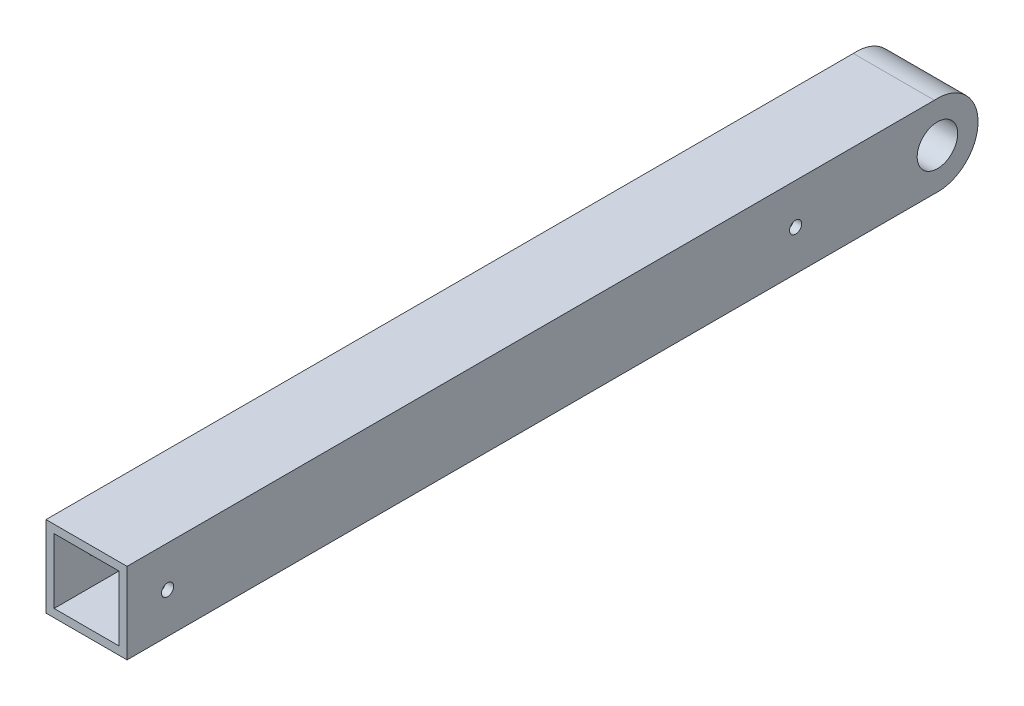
ISO-10303-21;
HEADER;
FILE_DESCRIPTION(('STEP AP214'),'2;1');
FILE_NAME('part.step','',(''),(''),'','','');
FILE_SCHEMA(('AUTOMOTIVE_DESIGN { 1 0 10303 214 1 1 1 1 }'));
ENDSEC;
DATA;
#1=APPLICATION_CONTEXT('core data for automotive mechanical design processes');
#2=APPLICATION_PROTOCOL_DEFINITION('international standard','automotive_design',2000,#1);
#3=PRODUCT_CONTEXT('',#1,'mechanical');
#4=PRODUCT('Part','Part','',(#3));
#5=PRODUCT_RELATED_PRODUCT_CATEGORY('part','',(#4));
#6=PRODUCT_DEFINITION_FORMATION('','',#4);
#7=PRODUCT_DEFINITION_CONTEXT('part definition',#1,'design');
#8=PRODUCT_DEFINITION('design','',#6,#7);
#9=PRODUCT_DEFINITION_SHAPE('','',#8);
#10=(LENGTH_UNIT() NAMED_UNIT(*) SI_UNIT(.MILLI.,.METRE.));
#11=(NAMED_UNIT(*) PLANE_ANGLE_UNIT() SI_UNIT($,.RADIAN.));
#12=(NAMED_UNIT(*) SI_UNIT($,.STERADIAN.) SOLID_ANGLE_UNIT());
#13=UNCERTAINTY_MEASURE_WITH_UNIT(LENGTH_MEASURE(1.E-05),#10,'distance_accuracy_value','');
#14=(GEOMETRIC_REPRESENTATION_CONTEXT(3) GLOBAL_UNCERTAINTY_ASSIGNED_CONTEXT((#13)) GLOBAL_UNIT_ASSIGNED_CONTEXT((#10,
#11,#12)) REPRESENTATION_CONTEXT('',''));
#15=CARTESIAN_POINT('',(0.,0.,0.));
#16=DIRECTION('',(0.,0.,1.));
#17=DIRECTION('',(1.,0.,0.));
#18=AXIS2_PLACEMENT_3D('',#15,#16,#17);
#19=CARTESIAN_POINT('',(0.,0.,200.));
#20=DIRECTION('',(0.,0.,1.));
#21=DIRECTION('',(1.,0.,0.));
#22=AXIS2_PLACEMENT_3D('',#19,#20,#21);
#23=PLANE('',#22);
#24=DIRECTION('',(0.,1.,0.));
#25=VECTOR('',#24,1.);
#26=CARTESIAN_POINT('',(0.,0.,200.));
#27=LINE('',#26,#25);
#28=CARTESIAN_POINT('',(0.,0.,200.));
#29=VERTEX_POINT('',#28);
#30=CARTESIAN_POINT('',(0.,20.,200.));
#31=VERTEX_POINT('',#30);
#32=EDGE_CURVE('E142',#29,#31,#27,.T.);
#33=ORIENTED_EDGE('',*,*,#32,.T.);
#34=DIRECTION('',(-1.,0.,0.));
#35=VECTOR('',#34,1.);
#36=CARTESIAN_POINT('',(0.,20.,200.));
#37=LINE('',#36,#35);
#38=CARTESIAN_POINT('',(-20.,20.,200.));
#39=VERTEX_POINT('',#38);
#40=EDGE_CURVE('E145',#31,#39,#37,.T.);
#41=ORIENTED_EDGE('',*,*,#40,.T.);
#42=DIRECTION('',(0.,1.,0.));
#43=VECTOR('',#42,1.);
#44=CARTESIAN_POINT('',(-20.,0.,200.));
#45=LINE('',#44,#43);
#46=CARTESIAN_POINT('',(-20.,0.,200.));
#47=VERTEX_POINT('',#46);
#48=EDGE_CURVE('E147',#47,#39,#45,.T.);
#49=ORIENTED_EDGE('',*,*,#48,.F.);
#50=DIRECTION('',(-1.,0.,0.));
#51=VECTOR('',#50,1.);
#52=CARTESIAN_POINT('',(0.,0.,200.));
#53=LINE('',#52,#51);
#54=EDGE_CURVE('E150',#29,#47,#53,.T.);
#55=ORIENTED_EDGE('',*,*,#54,.F.);
#56=EDGE_LOOP('',(#33,#41,#49,#55));
#57=FACE_BOUND('',#56,.T.);
#58=DIRECTION('',(-1.,0.,0.));
#59=VECTOR('',#58,1.);
#60=CARTESIAN_POINT('',(-2.,18.,200.));
#61=LINE('',#60,#59);
#62=CARTESIAN_POINT('',(-2.,18.,200.));
#63=VERTEX_POINT('',#62);
#64=CARTESIAN_POINT('',(-18.,18.,200.));
#65=VERTEX_POINT('',#64);
#66=EDGE_CURVE('E117',#63,#65,#61,.T.);
#67=ORIENTED_EDGE('',*,*,#66,.F.);
#68=DIRECTION('',(0.,-1.,0.));
#69=VECTOR('',#68,1.);
#70=CARTESIAN_POINT('',(-2.,18.,200.));
#71=LINE('',#70,#69);
#72=CARTESIAN_POINT('',(-2.,2.00000000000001,200.));
#73=VERTEX_POINT('',#72);
#74=EDGE_CURVE('E50',#63,#73,#71,.T.);
#75=ORIENTED_EDGE('',*,*,#74,.T.);
#76=DIRECTION('',(-1.,0.,0.));
#77=VECTOR('',#76,1.);
#78=CARTESIAN_POINT('',(-2.,2.00000000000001,200.));
#79=LINE('',#78,#77);
#80=CARTESIAN_POINT('',(-18.,2.00000000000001,200.));
#81=VERTEX_POINT('',#80);
#82=EDGE_CURVE('E121',#73,#81,#79,.T.);
#83=ORIENTED_EDGE('',*,*,#82,.T.);
#84=DIRECTION('',(0.,-1.,0.));
#85=VECTOR('',#84,1.);
#86=CARTESIAN_POINT('',(-18.,18.,200.));
#87=LINE('',#86,#85);
#88=EDGE_CURVE('E184',#65,#81,#87,.T.);
#89=ORIENTED_EDGE('',*,*,#88,.F.);
#90=EDGE_LOOP('',(#67,#75,#83,#89));
#91=FACE_BOUND('',#90,.T.);
#92=ADVANCED_FACE('F33',(#57,#91),#23,.T.);
#93=CARTESIAN_POINT('',(0.,0.,200.));
#94=DIRECTION('',(-1.,0.,0.));
#95=DIRECTION('',(0.,-1.,0.));
#96=AXIS2_PLACEMENT_3D('',#93,#94,#95);
#97=PLANE('',#96);
#98=CARTESIAN_POINT('',(0.,10.,190.));
#99=DIRECTION('',(1.,0.,0.));
#100=DIRECTION('',(0.,1.,0.));
#101=AXIS2_PLACEMENT_3D('',#98,#99,#100);
#102=CIRCLE('',#101,1.5);
#103=CARTESIAN_POINT('',(0.,11.5,190.));
#104=VERTEX_POINT('',#103);
#105=EDGE_CURVE('E267',#104,#104,#102,.T.);
#106=ORIENTED_EDGE('',*,*,#105,.F.);
#107=EDGE_LOOP('',(#106));
#108=FACE_BOUND('',#107,.T.);
#109=CARTESIAN_POINT('',(0.,10.,35.));
#110=DIRECTION('',(1.,0.,0.));
#111=DIRECTION('',(0.,1.,0.));
#112=AXIS2_PLACEMENT_3D('',#109,#110,#111);
#113=CIRCLE('',#112,1.5);
#114=CARTESIAN_POINT('',(0.,11.5,35.));
#115=VERTEX_POINT('',#114);
#116=EDGE_CURVE('E169',#115,#115,#113,.T.);
#117=ORIENTED_EDGE('',*,*,#116,.F.);
#118=EDGE_LOOP('',(#117));
#119=FACE_BOUND('',#118,.T.);
#120=CARTESIAN_POINT('',(0.,10.,0.));
#121=DIRECTION('',(1.,0.,0.));
#122=DIRECTION('',(0.,1.,0.));
#123=AXIS2_PLACEMENT_3D('',#120,#121,#122);
#124=CIRCLE('',#123,5.);
#125=CARTESIAN_POINT('',(0.,15.,0.));
#126=VERTEX_POINT('',#125);
#127=EDGE_CURVE('E122',#126,#126,#124,.T.);
#128=ORIENTED_EDGE('',*,*,#127,.F.);
#129=EDGE_LOOP('',(#128));
#130=FACE_BOUND('',#129,.T.);
#131=DIRECTION('',(0.,0.,-1.));
#132=VECTOR('',#131,1.);
#133=CARTESIAN_POINT('',(0.,0.,200.));
#134=LINE('',#133,#132);
#135=CARTESIAN_POINT('',(0.,0.,0.757787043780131));
#136=VERTEX_POINT('',#135);
#137=EDGE_CURVE('E58',#29,#136,#134,.T.);
#138=ORIENTED_EDGE('',*,*,#137,.T.);
#139=CARTESIAN_POINT('',(0.,10.,0.));
#140=DIRECTION('',(1.,0.,0.));
#141=DIRECTION('',(0.,1.,0.));
#142=AXIS2_PLACEMENT_3D('',#139,#140,#141);
#143=CIRCLE('',#142,10.0286709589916);
#144=CARTESIAN_POINT('',(0.,20.,0.757787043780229));
#145=VERTEX_POINT('',#144);
#146=EDGE_CURVE('E133',#136,#145,#143,.T.);
#147=ORIENTED_EDGE('',*,*,#146,.T.);
#148=DIRECTION('',(0.,0.,-1.));
#149=VECTOR('',#148,1.);
#150=CARTESIAN_POINT('',(0.,20.,200.));
#151=LINE('',#150,#149);
#152=EDGE_CURVE('E42',#31,#145,#151,.T.);
#153=ORIENTED_EDGE('',*,*,#152,.F.);
#154=ORIENTED_EDGE('',*,*,#32,.F.);
#155=EDGE_LOOP('',(#138,#147,#153,#154));
#156=FACE_BOUND('',#155,.T.);
#157=ADVANCED_FACE('F35',(#108,#119,#130,#156),#97,.F.);
#158=CARTESIAN_POINT('',(0.,20.,200.));
#159=DIRECTION('',(0.,-1.,0.));
#160=DIRECTION('',(1.,0.,0.));
#161=AXIS2_PLACEMENT_3D('',#158,#159,#160);
#162=PLANE('',#161);
#163=ORIENTED_EDGE('',*,*,#152,.T.);
#164=DIRECTION('',(1.,0.,0.));
#165=VECTOR('',#164,1.);
#166=CARTESIAN_POINT('',(-48.3653649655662,20.,0.757787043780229));
#167=LINE('',#166,#165);
#168=CARTESIAN_POINT('',(-20.,20.,0.757787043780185));
#169=VERTEX_POINT('',#168);
#170=EDGE_CURVE('E139',#145,#169,#167,.F.);
#171=ORIENTED_EDGE('',*,*,#170,.T.);
#172=DIRECTION('',(0.,0.,-1.));
#173=VECTOR('',#172,1.);
#174=CARTESIAN_POINT('',(-20.,20.,200.));
#175=LINE('',#174,#173);
#176=EDGE_CURVE('E156',#39,#169,#175,.T.);
#177=ORIENTED_EDGE('',*,*,#176,.F.);
#178=ORIENTED_EDGE('',*,*,#40,.F.);
#179=EDGE_LOOP('',(#163,#171,#177,#178));
#180=FACE_BOUND('',#179,.T.);
#181=ADVANCED_FACE('F202',(#180),#162,.F.);
#182=CARTESIAN_POINT('',(-20.,0.,200.));
#183=DIRECTION('',(-1.,0.,0.));
#184=DIRECTION('',(0.,0.,1.));
#185=AXIS2_PLACEMENT_3D('',#182,#183,#184);
#186=PLANE('',#185);
#187=CARTESIAN_POINT('',(-20.,10.,190.));
#188=DIRECTION('',(1.,0.,0.));
#189=DIRECTION('',(0.,1.,0.));
#190=AXIS2_PLACEMENT_3D('',#187,#188,#189);
#191=CIRCLE('',#190,1.5);
#192=CARTESIAN_POINT('',(-20.,11.5,190.));
#193=VERTEX_POINT('',#192);
#194=EDGE_CURVE('E268',#193,#193,#191,.T.);
#195=ORIENTED_EDGE('',*,*,#194,.T.);
#196=EDGE_LOOP('',(#195));
#197=FACE_BOUND('',#196,.T.);
#198=CARTESIAN_POINT('',(-20.,10.,35.));
#199=DIRECTION('',(1.,0.,0.));
#200=DIRECTION('',(0.,1.,0.));
#201=AXIS2_PLACEMENT_3D('',#198,#199,#200);
#202=CIRCLE('',#201,1.5);
#203=CARTESIAN_POINT('',(-20.,11.5,35.));
#204=VERTEX_POINT('',#203);
#205=EDGE_CURVE('E163',#204,#204,#202,.T.);
#206=ORIENTED_EDGE('',*,*,#205,.T.);
#207=EDGE_LOOP('',(#206));
#208=FACE_BOUND('',#207,.T.);
#209=CARTESIAN_POINT('',(-20.,10.,0.));
#210=DIRECTION('',(1.,0.,0.));
#211=DIRECTION('',(0.,1.,0.));
#212=AXIS2_PLACEMENT_3D('',#209,#210,#211);
#213=CIRCLE('',#212,5.);
#214=CARTESIAN_POINT('',(-20.,15.,0.));
#215=VERTEX_POINT('',#214);
#216=EDGE_CURVE('E126',#215,#215,#213,.T.);
#217=ORIENTED_EDGE('',*,*,#216,.T.);
#218=EDGE_LOOP('',(#217));
#219=FACE_BOUND('',#218,.T.);
#220=ORIENTED_EDGE('',*,*,#176,.T.);
#221=CARTESIAN_POINT('',(-20.,10.,0.));
#222=DIRECTION('',(-1.,0.,0.));
#223=DIRECTION('',(0.,0.,1.));
#224=AXIS2_PLACEMENT_3D('',#221,#222,#223);
#225=CIRCLE('',#224,10.0286709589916);
#226=CARTESIAN_POINT('',(-20.,0.,0.757787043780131));
#227=VERTEX_POINT('',#226);
#228=EDGE_CURVE('E137',#227,#169,#225,.F.);
#229=ORIENTED_EDGE('',*,*,#228,.F.);
#230=DIRECTION('',(0.,0.,-1.));
#231=VECTOR('',#230,1.);
#232=CARTESIAN_POINT('',(-20.,0.,200.));
#233=LINE('',#232,#231);
#234=EDGE_CURVE('E153',#47,#227,#233,.T.);
#235=ORIENTED_EDGE('',*,*,#234,.F.);
#236=ORIENTED_EDGE('',*,*,#48,.T.);
#237=EDGE_LOOP('',(#220,#229,#235,#236));
#238=FACE_BOUND('',#237,.T.);
#239=ADVANCED_FACE('F211',(#197,#208,#219,#238),#186,.T.);
#240=CARTESIAN_POINT('',(0.,0.,200.));
#241=DIRECTION('',(0.,-1.,0.));
#242=DIRECTION('',(0.,0.,-1.));
#243=AXIS2_PLACEMENT_3D('',#240,#241,#242);
#244=PLANE('',#243);
#245=DIRECTION('',(1.,0.,0.));
#246=VECTOR('',#245,1.);
#247=CARTESIAN_POINT('',(-48.3653649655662,0.,0.757787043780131));
#248=LINE('',#247,#246);
#249=EDGE_CURVE('E11',#136,#227,#248,.F.);
#250=ORIENTED_EDGE('',*,*,#249,.F.);
#251=ORIENTED_EDGE('',*,*,#137,.F.);
#252=ORIENTED_EDGE('',*,*,#54,.T.);
#253=ORIENTED_EDGE('',*,*,#234,.T.);
#254=EDGE_LOOP('',(#250,#251,#252,#253));
#255=FACE_BOUND('',#254,.T.);
#256=ADVANCED_FACE('F208',(#255),#244,.T.);
#257=CARTESIAN_POINT('',(-48.3653649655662,10.,0.));
#258=DIRECTION('',(1.,0.,0.));
#259=DIRECTION('',(0.,1.,0.));
#260=AXIS2_PLACEMENT_3D('',#257,#258,#259);
#261=CYLINDRICAL_SURFACE('',#260,10.0286709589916);
#262=ORIENTED_EDGE('',*,*,#170,.F.);
#263=ORIENTED_EDGE('',*,*,#146,.F.);
#264=ORIENTED_EDGE('',*,*,#249,.T.);
#265=ORIENTED_EDGE('',*,*,#228,.T.);
#266=EDGE_LOOP('',(#262,#263,#264,#265));
#267=FACE_BOUND('',#266,.T.);
#268=ADVANCED_FACE('F206',(#267),#261,.T.);
#269=CARTESIAN_POINT('',(-20.,10.,0.));
#270=DIRECTION('',(1.,0.,0.));
#271=DIRECTION('',(0.,1.,0.));
#272=AXIS2_PLACEMENT_3D('',#269,#270,#271);
#273=CYLINDRICAL_SURFACE('',#272,5.);
#274=ORIENTED_EDGE('',*,*,#216,.F.);
#275=EDGE_LOOP('',(#274));
#276=FACE_BOUND('',#275,.T.);
#277=ORIENTED_EDGE('',*,*,#127,.T.);
#278=EDGE_LOOP('',(#277));
#279=FACE_BOUND('',#278,.T.);
#280=ADVANCED_FACE('F227',(#276,#279),#273,.F.);
#281=CARTESIAN_POINT('',(-2.,18.,30.));
#282=DIRECTION('',(-1.,0.,0.));
#283=DIRECTION('',(0.,-1.,0.));
#284=AXIS2_PLACEMENT_3D('',#281,#282,#283);
#285=PLANE('',#284);
#286=CARTESIAN_POINT('',(-2.,10.,190.));
#287=DIRECTION('',(-1.,0.,0.));
#288=DIRECTION('',(0.,-1.,0.));
#289=AXIS2_PLACEMENT_3D('',#286,#287,#288);
#290=CIRCLE('',#289,1.5);
#291=CARTESIAN_POINT('',(-2.,8.50000000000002,190.));
#292=VERTEX_POINT('',#291);
#293=EDGE_CURVE('E174',#292,#292,#290,.T.);
#294=ORIENTED_EDGE('',*,*,#293,.F.);
#295=EDGE_LOOP('',(#294));
#296=FACE_BOUND('',#295,.T.);
#297=CARTESIAN_POINT('',(-2.,10.,35.));
#298=DIRECTION('',(-1.,0.,0.));
#299=DIRECTION('',(0.,-1.,0.));
#300=AXIS2_PLACEMENT_3D('',#297,#298,#299);
#301=CIRCLE('',#300,1.5);
#302=CARTESIAN_POINT('',(-2.,8.50000000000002,35.));
#303=VERTEX_POINT('',#302);
#304=EDGE_CURVE('E162',#303,#303,#301,.T.);
#305=ORIENTED_EDGE('',*,*,#304,.F.);
#306=EDGE_LOOP('',(#305));
#307=FACE_BOUND('',#306,.T.);
#308=ORIENTED_EDGE('',*,*,#74,.F.);
#309=DIRECTION('',(0.,0.,1.));
#310=VECTOR('',#309,1.);
#311=CARTESIAN_POINT('',(-2.,18.,30.));
#312=LINE('',#311,#310);
#313=CARTESIAN_POINT('',(-2.,18.,30.));
#314=VERTEX_POINT('',#313);
#315=EDGE_CURVE('E116',#314,#63,#312,.T.);
#316=ORIENTED_EDGE('',*,*,#315,.F.);
#317=DIRECTION('',(0.,-1.,0.));
#318=VECTOR('',#317,1.);
#319=CARTESIAN_POINT('',(-2.,18.,30.));
#320=LINE('',#319,#318);
#321=CARTESIAN_POINT('',(-2.,2.00000000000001,30.));
#322=VERTEX_POINT('',#321);
#323=EDGE_CURVE('E106',#314,#322,#320,.T.);
#324=ORIENTED_EDGE('',*,*,#323,.T.);
#325=DIRECTION('',(0.,0.,1.));
#326=VECTOR('',#325,1.);
#327=CARTESIAN_POINT('',(-2.,2.00000000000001,30.));
#328=LINE('',#327,#326);
#329=EDGE_CURVE('E115',#322,#73,#328,.T.);
#330=ORIENTED_EDGE('',*,*,#329,.T.);
#331=EDGE_LOOP('',(#308,#316,#324,#330));
#332=FACE_BOUND('',#331,.T.);
#333=ADVANCED_FACE('F114',(#296,#307,#332),#285,.T.);
#334=CARTESIAN_POINT('',(-2.,2.00000000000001,30.));
#335=DIRECTION('',(0.,1.,0.));
#336=DIRECTION('',(-1.,0.,0.));
#337=AXIS2_PLACEMENT_3D('',#334,#335,#336);
#338=PLANE('',#337);
#339=ORIENTED_EDGE('',*,*,#82,.F.);
#340=ORIENTED_EDGE('',*,*,#329,.F.);
#341=DIRECTION('',(-1.,0.,0.));
#342=VECTOR('',#341,1.);
#343=CARTESIAN_POINT('',(-2.,2.00000000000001,30.));
#344=LINE('',#343,#342);
#345=CARTESIAN_POINT('',(-18.,2.00000000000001,30.));
#346=VERTEX_POINT('',#345);
#347=EDGE_CURVE('E102',#322,#346,#344,.T.);
#348=ORIENTED_EDGE('',*,*,#347,.T.);
#349=DIRECTION('',(0.,0.,1.));
#350=VECTOR('',#349,1.);
#351=CARTESIAN_POINT('',(-18.,2.00000000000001,30.));
#352=LINE('',#351,#350);
#353=EDGE_CURVE('E123',#346,#81,#352,.T.);
#354=ORIENTED_EDGE('',*,*,#353,.T.);
#355=EDGE_LOOP('',(#339,#340,#348,#354));
#356=FACE_BOUND('',#355,.T.);
#357=ADVANCED_FACE('F119',(#356),#338,.T.);
#358=CARTESIAN_POINT('',(-18.,18.,30.));
#359=DIRECTION('',(-1.,0.,0.));
#360=DIRECTION('',(0.,-1.,0.));
#361=AXIS2_PLACEMENT_3D('',#358,#359,#360);
#362=PLANE('',#361);
#363=CARTESIAN_POINT('',(-18.,10.,190.));
#364=DIRECTION('',(-1.,0.,0.));
#365=DIRECTION('',(0.,-1.,0.));
#366=AXIS2_PLACEMENT_3D('',#363,#364,#365);
#367=CIRCLE('',#366,1.5);
#368=CARTESIAN_POINT('',(-18.,8.50000000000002,190.));
#369=VERTEX_POINT('',#368);
#370=EDGE_CURVE('E37',#369,#369,#367,.T.);
#371=ORIENTED_EDGE('',*,*,#370,.T.);
#372=EDGE_LOOP('',(#371));
#373=FACE_BOUND('',#372,.T.);
#374=CARTESIAN_POINT('',(-18.,10.,35.));
#375=DIRECTION('',(-1.,0.,0.));
#376=DIRECTION('',(0.,-1.,0.));
#377=AXIS2_PLACEMENT_3D('',#374,#375,#376);
#378=CIRCLE('',#377,1.5);
#379=CARTESIAN_POINT('',(-18.,8.50000000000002,35.));
#380=VERTEX_POINT('',#379);
#381=EDGE_CURVE('E160',#380,#380,#378,.T.);
#382=ORIENTED_EDGE('',*,*,#381,.T.);
#383=EDGE_LOOP('',(#382));
#384=FACE_BOUND('',#383,.T.);
#385=ORIENTED_EDGE('',*,*,#88,.T.);
#386=ORIENTED_EDGE('',*,*,#353,.F.);
#387=DIRECTION('',(0.,-1.,0.));
#388=VECTOR('',#387,1.);
#389=CARTESIAN_POINT('',(-18.,18.,30.));
#390=LINE('',#389,#388);
#391=CARTESIAN_POINT('',(-18.,18.,30.));
#392=VERTEX_POINT('',#391);
#393=EDGE_CURVE('E109',#392,#346,#390,.T.);
#394=ORIENTED_EDGE('',*,*,#393,.F.);
#395=DIRECTION('',(0.,0.,1.));
#396=VECTOR('',#395,1.);
#397=CARTESIAN_POINT('',(-18.,18.,30.));
#398=LINE('',#397,#396);
#399=EDGE_CURVE('E128',#392,#65,#398,.T.);
#400=ORIENTED_EDGE('',*,*,#399,.T.);
#401=EDGE_LOOP('',(#385,#386,#394,#400));
#402=FACE_BOUND('',#401,.T.);
#403=ADVANCED_FACE('F190',(#373,#384,#402),#362,.F.);
#404=CARTESIAN_POINT('',(-2.,18.,30.));
#405=DIRECTION('',(0.,1.,0.));
#406=DIRECTION('',(-1.,0.,0.));
#407=AXIS2_PLACEMENT_3D('',#404,#405,#406);
#408=PLANE('',#407);
#409=ORIENTED_EDGE('',*,*,#66,.T.);
#410=ORIENTED_EDGE('',*,*,#399,.F.);
#411=DIRECTION('',(-1.,0.,0.));
#412=VECTOR('',#411,1.);
#413=CARTESIAN_POINT('',(-2.,18.,30.));
#414=LINE('',#413,#412);
#415=EDGE_CURVE('E180',#314,#392,#414,.T.);
#416=ORIENTED_EDGE('',*,*,#415,.F.);
#417=ORIENTED_EDGE('',*,*,#315,.T.);
#418=EDGE_LOOP('',(#409,#410,#416,#417));
#419=FACE_BOUND('',#418,.T.);
#420=ADVANCED_FACE('F194',(#419),#408,.F.);
#421=CARTESIAN_POINT('',(0.,0.,30.));
#422=DIRECTION('',(0.,0.,-1.));
#423=DIRECTION('',(-1.,0.,0.));
#424=AXIS2_PLACEMENT_3D('',#421,#422,#423);
#425=PLANE('',#424);
#426=ORIENTED_EDGE('',*,*,#323,.F.);
#427=ORIENTED_EDGE('',*,*,#415,.T.);
#428=ORIENTED_EDGE('',*,*,#393,.T.);
#429=ORIENTED_EDGE('',*,*,#347,.F.);
#430=EDGE_LOOP('',(#426,#427,#428,#429));
#431=FACE_BOUND('',#430,.T.);
#432=ADVANCED_FACE('F104',(#431),#425,.F.);
#433=CARTESIAN_POINT('',(-20.,10.,35.));
#434=DIRECTION('',(1.,0.,0.));
#435=DIRECTION('',(0.,1.,0.));
#436=AXIS2_PLACEMENT_3D('',#433,#434,#435);
#437=CYLINDRICAL_SURFACE('',#436,1.5);
#438=ORIENTED_EDGE('',*,*,#205,.F.);
#439=EDGE_LOOP('',(#438));
#440=FACE_BOUND('',#439,.T.);
#441=ORIENTED_EDGE('',*,*,#381,.F.);
#442=EDGE_LOOP('',(#441));
#443=FACE_BOUND('',#442,.T.);
#444=ADVANCED_FACE('F249',(#440,#443),#437,.F.);
#445=ORIENTED_EDGE('',*,*,#304,.T.);
#446=EDGE_LOOP('',(#445));
#447=FACE_BOUND('',#446,.T.);
#448=ORIENTED_EDGE('',*,*,#116,.T.);
#449=EDGE_LOOP('',(#448));
#450=FACE_BOUND('',#449,.T.);
#451=ADVANCED_FACE('F250',(#447,#450),#437,.F.);
#452=CARTESIAN_POINT('',(-20.,10.,190.));
#453=DIRECTION('',(1.,0.,0.));
#454=DIRECTION('',(0.,1.,0.));
#455=AXIS2_PLACEMENT_3D('',#452,#453,#454);
#456=CYLINDRICAL_SURFACE('',#455,1.5);
#457=ORIENTED_EDGE('',*,*,#194,.F.);
#458=EDGE_LOOP('',(#457));
#459=FACE_BOUND('',#458,.T.);
#460=ORIENTED_EDGE('',*,*,#370,.F.);
#461=EDGE_LOOP('',(#460));
#462=FACE_BOUND('',#461,.T.);
#463=ADVANCED_FACE('F253',(#459,#462),#456,.F.);
#464=ORIENTED_EDGE('',*,*,#293,.T.);
#465=EDGE_LOOP('',(#464));
#466=FACE_BOUND('',#465,.T.);
#467=ORIENTED_EDGE('',*,*,#105,.T.);
#468=EDGE_LOOP('',(#467));
#469=FACE_BOUND('',#468,.T.);
#470=ADVANCED_FACE('F255',(#466,#469),#456,.F.);
#471=CLOSED_SHELL('',(#92,#157,#181,#239,#256,#268,#280,#333,#357,#403,#420,#432,#444,#451,#463,#470));
#472=MANIFOLD_SOLID_BREP('B2',#471);
#473=ADVANCED_BREP_SHAPE_REPRESENTATION('',(#18,#472),#14);
#474=SHAPE_DEFINITION_REPRESENTATION(#9,#473);
ENDSEC;
END-ISO-10303-21;
